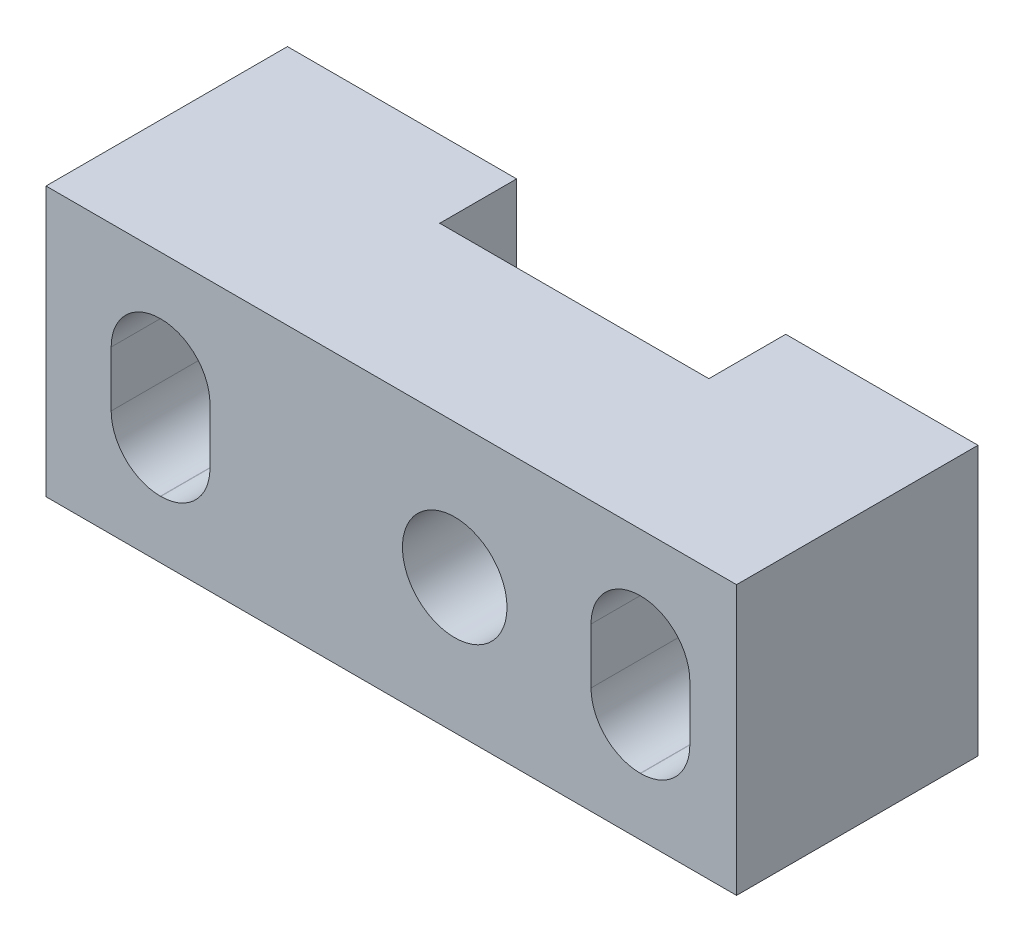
ISO-10303-21;
HEADER;
FILE_DESCRIPTION(('STEP AP214'),'2;1');
FILE_NAME('part.step','',(''),(''),'','','');
FILE_SCHEMA(('AUTOMOTIVE_DESIGN { 1 0 10303 214 1 1 1 1 }'));
ENDSEC;
DATA;
#1=APPLICATION_CONTEXT('core data for automotive mechanical design processes');
#2=APPLICATION_PROTOCOL_DEFINITION('international standard','automotive_design',2000,#1);
#3=PRODUCT_CONTEXT('',#1,'mechanical');
#4=PRODUCT('Part','Part','',(#3));
#5=PRODUCT_RELATED_PRODUCT_CATEGORY('part','',(#4));
#6=PRODUCT_DEFINITION_FORMATION('','',#4);
#7=PRODUCT_DEFINITION_CONTEXT('part definition',#1,'design');
#8=PRODUCT_DEFINITION('design','',#6,#7);
#9=PRODUCT_DEFINITION_SHAPE('','',#8);
#10=(LENGTH_UNIT() NAMED_UNIT(*) SI_UNIT(.MILLI.,.METRE.));
#11=(NAMED_UNIT(*) PLANE_ANGLE_UNIT() SI_UNIT($,.RADIAN.));
#12=(NAMED_UNIT(*) SI_UNIT($,.STERADIAN.) SOLID_ANGLE_UNIT());
#13=UNCERTAINTY_MEASURE_WITH_UNIT(LENGTH_MEASURE(1.E-05),#10,'distance_accuracy_value','');
#14=(GEOMETRIC_REPRESENTATION_CONTEXT(3) GLOBAL_UNCERTAINTY_ASSIGNED_CONTEXT((#13)) GLOBAL_UNIT_ASSIGNED_CONTEXT((#10,
#11,#12)) REPRESENTATION_CONTEXT('',''));
#15=CARTESIAN_POINT('',(0.,0.,0.));
#16=DIRECTION('',(0.,0.,1.));
#17=DIRECTION('',(1.,0.,0.));
#18=AXIS2_PLACEMENT_3D('',#15,#16,#17);
#19=CARTESIAN_POINT('',(-13.5001,-8.89,0.));
#20=DIRECTION('',(0.,0.,1.));
#21=DIRECTION('',(1.,0.,0.));
#22=AXIS2_PLACEMENT_3D('',#19,#20,#21);
#23=PLANE('',#22);
#24=DIRECTION('',(0.,1.,0.));
#25=VECTOR('',#24,1.);
#26=CARTESIAN_POINT('',(7.76605,-1.90499999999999,0.));
#27=LINE('',#26,#25);
#28=CARTESIAN_POINT('',(7.76605,-5.3594,0.));
#29=VERTEX_POINT('',#28);
#30=CARTESIAN_POINT('',(7.76605,-3.53059999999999,0.));
#31=VERTEX_POINT('',#30);
#32=EDGE_CURVE('E383',#29,#31,#27,.T.);
#33=ORIENTED_EDGE('',*,*,#32,.T.);
#34=CARTESIAN_POINT('',(6.14045,-3.53059999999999,0.));
#35=DIRECTION('',(0.,0.,1.));
#36=DIRECTION('',(1.,0.,0.));
#37=AXIS2_PLACEMENT_3D('',#34,#35,#36);
#38=CIRCLE('',#37,1.6256);
#39=CARTESIAN_POINT('',(6.14045,-1.90499999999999,0.));
#40=VERTEX_POINT('',#39);
#41=EDGE_CURVE('E297',#31,#40,#38,.T.);
#42=ORIENTED_EDGE('',*,*,#41,.T.);
#43=DIRECTION('',(-1.,0.,0.));
#44=VECTOR('',#43,1.);
#45=CARTESIAN_POINT('',(4.50215,-1.90499999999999,0.));
#46=LINE('',#45,#44);
#47=CARTESIAN_POINT('',(6.12775,-1.90499999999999,0.));
#48=VERTEX_POINT('',#47);
#49=EDGE_CURVE('E224',#40,#48,#46,.T.);
#50=ORIENTED_EDGE('',*,*,#49,.T.);
#51=CARTESIAN_POINT('',(6.12775,-3.53059999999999,0.));
#52=DIRECTION('',(0.,0.,1.));
#53=DIRECTION('',(1.,0.,0.));
#54=AXIS2_PLACEMENT_3D('',#51,#52,#53);
#55=CIRCLE('',#54,1.6256);
#56=CARTESIAN_POINT('',(4.50215,-3.53059999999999,0.));
#57=VERTEX_POINT('',#56);
#58=EDGE_CURVE('E293',#48,#57,#55,.T.);
#59=ORIENTED_EDGE('',*,*,#58,.T.);
#60=DIRECTION('',(0.,-1.,0.));
#61=VECTOR('',#60,1.);
#62=CARTESIAN_POINT('',(4.50215,-1.90499999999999,0.));
#63=LINE('',#62,#61);
#64=CARTESIAN_POINT('',(4.50215,-5.3594,0.));
#65=VERTEX_POINT('',#64);
#66=EDGE_CURVE('E376',#57,#65,#63,.T.);
#67=ORIENTED_EDGE('',*,*,#66,.T.);
#68=CARTESIAN_POINT('',(6.12775,-5.3594,0.));
#69=DIRECTION('',(0.,0.,1.));
#70=DIRECTION('',(1.,0.,0.));
#71=AXIS2_PLACEMENT_3D('',#68,#69,#70);
#72=CIRCLE('',#71,1.6256);
#73=CARTESIAN_POINT('',(6.12775,-6.985,0.));
#74=VERTEX_POINT('',#73);
#75=EDGE_CURVE('E305',#65,#74,#72,.T.);
#76=ORIENTED_EDGE('',*,*,#75,.T.);
#77=DIRECTION('',(1.,0.,0.));
#78=VECTOR('',#77,1.);
#79=CARTESIAN_POINT('',(4.50215,-6.985,0.));
#80=LINE('',#79,#78);
#81=CARTESIAN_POINT('',(6.14045,-6.985,0.));
#82=VERTEX_POINT('',#81);
#83=EDGE_CURVE('E379',#74,#82,#80,.T.);
#84=ORIENTED_EDGE('',*,*,#83,.T.);
#85=CARTESIAN_POINT('',(6.14045,-5.3594,0.));
#86=DIRECTION('',(0.,0.,1.));
#87=DIRECTION('',(1.,0.,0.));
#88=AXIS2_PLACEMENT_3D('',#85,#86,#87);
#89=CIRCLE('',#88,1.6256);
#90=EDGE_CURVE('E301',#82,#29,#89,.T.);
#91=ORIENTED_EDGE('',*,*,#90,.T.);
#92=EDGE_LOOP('',(#33,#42,#50,#59,#67,#76,#84,#91));
#93=FACE_BOUND('',#92,.T.);
#94=DIRECTION('',(1.,0.,0.));
#95=VECTOR('',#94,1.);
#96=CARTESIAN_POINT('',(-13.5001,-8.89,0.));
#97=LINE('',#96,#95);
#98=CARTESIAN_POINT('',(2.9591,-8.89,0.));
#99=VERTEX_POINT('',#98);
#100=CARTESIAN_POINT('',(9.3091,-8.89,0.));
#101=VERTEX_POINT('',#100);
#102=EDGE_CURVE('E250',#99,#101,#97,.T.);
#103=ORIENTED_EDGE('',*,*,#102,.F.);
#104=DIRECTION('',(0.,-1.,0.));
#105=VECTOR('',#104,1.);
#106=CARTESIAN_POINT('',(2.9591,-8.89,0.));
#107=LINE('',#106,#105);
#108=CARTESIAN_POINT('',(2.9591,0.,0.));
#109=VERTEX_POINT('',#108);
#110=EDGE_CURVE('E197',#109,#99,#107,.T.);
#111=ORIENTED_EDGE('',*,*,#110,.F.);
#112=DIRECTION('',(-1.,0.,0.));
#113=VECTOR('',#112,1.);
#114=CARTESIAN_POINT('',(-13.5001,0.,0.));
#115=LINE('',#114,#113);
#116=CARTESIAN_POINT('',(9.3091,0.,0.));
#117=VERTEX_POINT('',#116);
#118=EDGE_CURVE('E241',#117,#109,#115,.T.);
#119=ORIENTED_EDGE('',*,*,#118,.F.);
#120=DIRECTION('',(0.,1.,0.));
#121=VECTOR('',#120,1.);
#122=CARTESIAN_POINT('',(9.3091,0.,0.));
#123=LINE('',#122,#121);
#124=EDGE_CURVE('E253',#101,#117,#123,.T.);
#125=ORIENTED_EDGE('',*,*,#124,.F.);
#126=EDGE_LOOP('',(#103,#111,#119,#125));
#127=FACE_BOUND('',#126,.T.);
#128=ADVANCED_FACE('F30',(#93,#127),#23,.F.);
#129=CARTESIAN_POINT('',(-13.5001,0.,7.9756));
#130=DIRECTION('',(1.,0.,0.));
#131=DIRECTION('',(0.,1.,0.));
#132=AXIS2_PLACEMENT_3D('',#129,#130,#131);
#133=PLANE('',#132);
#134=DIRECTION('',(0.,-1.,0.));
#135=VECTOR('',#134,1.);
#136=CARTESIAN_POINT('',(-13.5001,0.,0.));
#137=LINE('',#136,#135);
#138=CARTESIAN_POINT('',(-13.5001,0.,0.));
#139=VERTEX_POINT('',#138);
#140=CARTESIAN_POINT('',(-13.5001,-8.89,0.));
#141=VERTEX_POINT('',#140);
#142=EDGE_CURVE('E236',#139,#141,#137,.T.);
#143=ORIENTED_EDGE('',*,*,#142,.T.);
#144=DIRECTION('',(0.,0.,-1.));
#145=VECTOR('',#144,1.);
#146=CARTESIAN_POINT('',(-13.5001,-8.89,7.9756));
#147=LINE('',#146,#145);
#148=CARTESIAN_POINT('',(-13.5001,-8.89,7.9756));
#149=VERTEX_POINT('',#148);
#150=EDGE_CURVE('E266',#149,#141,#147,.T.);
#151=ORIENTED_EDGE('',*,*,#150,.F.);
#152=DIRECTION('',(0.,-1.,0.));
#153=VECTOR('',#152,1.);
#154=CARTESIAN_POINT('',(-13.5001,0.,7.9756));
#155=LINE('',#154,#153);
#156=CARTESIAN_POINT('',(-13.5001,0.,7.9756));
#157=VERTEX_POINT('',#156);
#158=EDGE_CURVE('E237',#157,#149,#155,.T.);
#159=ORIENTED_EDGE('',*,*,#158,.F.);
#160=DIRECTION('',(0.,0.,-1.));
#161=VECTOR('',#160,1.);
#162=CARTESIAN_POINT('',(-13.5001,0.,7.9756));
#163=LINE('',#162,#161);
#164=EDGE_CURVE('E247',#157,#139,#163,.T.);
#165=ORIENTED_EDGE('',*,*,#164,.T.);
#166=EDGE_LOOP('',(#143,#151,#159,#165));
#167=FACE_BOUND('',#166,.T.);
#168=ADVANCED_FACE('F446',(#167),#133,.F.);
#169=CARTESIAN_POINT('',(-13.5001,-8.89,7.9756));
#170=DIRECTION('',(0.,1.,0.));
#171=DIRECTION('',(0.,0.,1.));
#172=AXIS2_PLACEMENT_3D('',#169,#170,#171);
#173=PLANE('',#172);
#174=DIRECTION('',(-1.,0.,0.));
#175=VECTOR('',#174,1.);
#176=CARTESIAN_POINT('',(2.9591,-8.89,2.54));
#177=LINE('',#176,#175);
#178=CARTESIAN_POINT('',(2.9591,-8.89,2.54));
#179=VERTEX_POINT('',#178);
#180=CARTESIAN_POINT('',(-5.9309,-8.89,2.54));
#181=VERTEX_POINT('',#180);
#182=EDGE_CURVE('E209',#179,#181,#177,.T.);
#183=ORIENTED_EDGE('',*,*,#182,.F.);
#184=DIRECTION('',(0.,0.,-1.));
#185=VECTOR('',#184,1.);
#186=CARTESIAN_POINT('',(2.9591,-8.89,2.54));
#187=LINE('',#186,#185);
#188=EDGE_CURVE('E191',#179,#99,#187,.T.);
#189=ORIENTED_EDGE('',*,*,#188,.T.);
#190=ORIENTED_EDGE('',*,*,#102,.T.);
#191=DIRECTION('',(0.,0.,-1.));
#192=VECTOR('',#191,1.);
#193=CARTESIAN_POINT('',(9.3091,-8.89,7.9756));
#194=LINE('',#193,#192);
#195=CARTESIAN_POINT('',(9.3091,-8.89,7.9756));
#196=VERTEX_POINT('',#195);
#197=EDGE_CURVE('E263',#196,#101,#194,.T.);
#198=ORIENTED_EDGE('',*,*,#197,.F.);
#199=DIRECTION('',(1.,0.,0.));
#200=VECTOR('',#199,1.);
#201=CARTESIAN_POINT('',(-13.5001,-8.89,7.9756));
#202=LINE('',#201,#200);
#203=EDGE_CURVE('E240',#149,#196,#202,.T.);
#204=ORIENTED_EDGE('',*,*,#203,.F.);
#205=ORIENTED_EDGE('',*,*,#150,.T.);
#206=CARTESIAN_POINT('',(-5.9309,-8.89,0.));
#207=VERTEX_POINT('',#206);
#208=EDGE_CURVE('E251',#141,#207,#97,.T.);
#209=ORIENTED_EDGE('',*,*,#208,.T.);
#210=DIRECTION('',(0.,0.,-1.));
#211=VECTOR('',#210,1.);
#212=CARTESIAN_POINT('',(-5.9309,-8.89,2.54));
#213=LINE('',#212,#211);
#214=EDGE_CURVE('E201',#181,#207,#213,.T.);
#215=ORIENTED_EDGE('',*,*,#214,.F.);
#216=EDGE_LOOP('',(#183,#189,#190,#198,#204,#205,#209,#215));
#217=FACE_BOUND('',#216,.T.);
#218=ADVANCED_FACE('F215',(#217),#173,.F.);
#219=CARTESIAN_POINT('',(9.3091,0.,7.9756));
#220=DIRECTION('',(-1.,0.,0.));
#221=DIRECTION('',(0.,-1.,0.));
#222=AXIS2_PLACEMENT_3D('',#219,#220,#221);
#223=PLANE('',#222);
#224=ORIENTED_EDGE('',*,*,#124,.T.);
#225=DIRECTION('',(0.,0.,-1.));
#226=VECTOR('',#225,1.);
#227=CARTESIAN_POINT('',(9.3091,0.,7.9756));
#228=LINE('',#227,#226);
#229=CARTESIAN_POINT('',(9.3091,0.,7.9756));
#230=VERTEX_POINT('',#229);
#231=EDGE_CURVE('E260',#230,#117,#228,.T.);
#232=ORIENTED_EDGE('',*,*,#231,.F.);
#233=DIRECTION('',(0.,1.,0.));
#234=VECTOR('',#233,1.);
#235=CARTESIAN_POINT('',(9.3091,0.,7.9756));
#236=LINE('',#235,#234);
#237=EDGE_CURVE('E243',#196,#230,#236,.T.);
#238=ORIENTED_EDGE('',*,*,#237,.F.);
#239=ORIENTED_EDGE('',*,*,#197,.T.);
#240=EDGE_LOOP('',(#224,#232,#238,#239));
#241=FACE_BOUND('',#240,.T.);
#242=ADVANCED_FACE('F452',(#241),#223,.F.);
#243=CARTESIAN_POINT('',(-13.5001,0.,7.9756));
#244=DIRECTION('',(0.,-1.,0.));
#245=DIRECTION('',(0.,0.,-1.));
#246=AXIS2_PLACEMENT_3D('',#243,#244,#245);
#247=PLANE('',#246);
#248=ORIENTED_EDGE('',*,*,#118,.T.);
#249=DIRECTION('',(0.,0.,-1.));
#250=VECTOR('',#249,1.);
#251=CARTESIAN_POINT('',(2.9591,0.,2.54));
#252=LINE('',#251,#250);
#253=CARTESIAN_POINT('',(2.9591,0.,2.54));
#254=VERTEX_POINT('',#253);
#255=EDGE_CURVE('E226',#254,#109,#252,.T.);
#256=ORIENTED_EDGE('',*,*,#255,.F.);
#257=DIRECTION('',(1.,0.,0.));
#258=VECTOR('',#257,1.);
#259=CARTESIAN_POINT('',(2.9591,0.,2.54));
#260=LINE('',#259,#258);
#261=CARTESIAN_POINT('',(-5.9309,0.,2.54));
#262=VERTEX_POINT('',#261);
#263=EDGE_CURVE('E202',#262,#254,#260,.T.);
#264=ORIENTED_EDGE('',*,*,#263,.F.);
#265=DIRECTION('',(0.,0.,-1.));
#266=VECTOR('',#265,1.);
#267=CARTESIAN_POINT('',(-5.9309,0.,2.54));
#268=LINE('',#267,#266);
#269=CARTESIAN_POINT('',(-5.9309,0.,0.));
#270=VERTEX_POINT('',#269);
#271=EDGE_CURVE('E229',#262,#270,#268,.T.);
#272=ORIENTED_EDGE('',*,*,#271,.T.);
#273=EDGE_CURVE('E255',#270,#139,#115,.T.);
#274=ORIENTED_EDGE('',*,*,#273,.T.);
#275=ORIENTED_EDGE('',*,*,#164,.F.);
#276=DIRECTION('',(-1.,0.,0.));
#277=VECTOR('',#276,1.);
#278=CARTESIAN_POINT('',(-13.5001,0.,7.9756));
#279=LINE('',#278,#277);
#280=EDGE_CURVE('E245',#230,#157,#279,.T.);
#281=ORIENTED_EDGE('',*,*,#280,.F.);
#282=ORIENTED_EDGE('',*,*,#231,.T.);
#283=EDGE_LOOP('',(#248,#256,#264,#272,#274,#275,#281,#282));
#284=FACE_BOUND('',#283,.T.);
#285=ADVANCED_FACE('F436',(#284),#247,.F.);
#286=CARTESIAN_POINT('',(-13.5001,-8.89,7.9756));
#287=DIRECTION('',(0.,0.,1.));
#288=DIRECTION('',(1.,0.,0.));
#289=AXIS2_PLACEMENT_3D('',#286,#287,#288);
#290=PLANE('',#289);
#291=DIRECTION('',(0.,-1.,0.));
#292=VECTOR('',#291,1.);
#293=CARTESIAN_POINT('',(-11.34745,-1.90499999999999,7.9756));
#294=LINE('',#293,#292);
#295=CARTESIAN_POINT('',(-11.34745,-3.53059999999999,7.9756));
#296=VERTEX_POINT('',#295);
#297=CARTESIAN_POINT('',(-11.34745,-5.3594,7.9756));
#298=VERTEX_POINT('',#297);
#299=EDGE_CURVE('E343',#296,#298,#294,.T.);
#300=ORIENTED_EDGE('',*,*,#299,.F.);
#301=CARTESIAN_POINT('',(-9.72185,-3.53059999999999,7.9756));
#302=DIRECTION('',(0.,0.,1.));
#303=DIRECTION('',(1.,0.,0.));
#304=AXIS2_PLACEMENT_3D('',#301,#302,#303);
#305=CIRCLE('',#304,1.6256);
#306=CARTESIAN_POINT('',(-9.72185,-1.90499999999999,7.9756));
#307=VERTEX_POINT('',#306);
#308=EDGE_CURVE('E38',#296,#307,#305,.F.);
#309=ORIENTED_EDGE('',*,*,#308,.T.);
#310=DIRECTION('',(-1.,0.,0.));
#311=VECTOR('',#310,1.);
#312=CARTESIAN_POINT('',(-11.34745,-1.90499999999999,7.9756));
#313=LINE('',#312,#311);
#314=CARTESIAN_POINT('',(-9.70915,-1.90499999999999,7.9756));
#315=VERTEX_POINT('',#314);
#316=EDGE_CURVE('E341',#315,#307,#313,.T.);
#317=ORIENTED_EDGE('',*,*,#316,.F.);
#318=CARTESIAN_POINT('',(-9.70915,-3.53059999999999,7.9756));
#319=DIRECTION('',(0.,0.,1.));
#320=DIRECTION('',(1.,0.,0.));
#321=AXIS2_PLACEMENT_3D('',#318,#319,#320);
#322=CIRCLE('',#321,1.6256);
#323=CARTESIAN_POINT('',(-8.08355,-3.53059999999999,7.9756));
#324=VERTEX_POINT('',#323);
#325=EDGE_CURVE('E334',#315,#324,#322,.F.);
#326=ORIENTED_EDGE('',*,*,#325,.T.);
#327=DIRECTION('',(0.,1.,0.));
#328=VECTOR('',#327,1.);
#329=CARTESIAN_POINT('',(-8.08355,-1.90499999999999,7.9756));
#330=LINE('',#329,#328);
#331=CARTESIAN_POINT('',(-8.08355,-5.3594,7.9756));
#332=VERTEX_POINT('',#331);
#333=EDGE_CURVE('E349',#332,#324,#330,.T.);
#334=ORIENTED_EDGE('',*,*,#333,.F.);
#335=CARTESIAN_POINT('',(-9.70915,-5.3594,7.9756));
#336=DIRECTION('',(0.,0.,1.));
#337=DIRECTION('',(1.,0.,0.));
#338=AXIS2_PLACEMENT_3D('',#335,#336,#337);
#339=CIRCLE('',#338,1.6256);
#340=CARTESIAN_POINT('',(-9.70915,-6.985,7.9756));
#341=VERTEX_POINT('',#340);
#342=EDGE_CURVE('E330',#332,#341,#339,.F.);
#343=ORIENTED_EDGE('',*,*,#342,.T.);
#344=DIRECTION('',(1.,0.,0.));
#345=VECTOR('',#344,1.);
#346=CARTESIAN_POINT('',(-11.34745,-6.985,7.9756));
#347=LINE('',#346,#345);
#348=CARTESIAN_POINT('',(-9.72185,-6.985,7.9756));
#349=VERTEX_POINT('',#348);
#350=EDGE_CURVE('E371',#349,#341,#347,.T.);
#351=ORIENTED_EDGE('',*,*,#350,.F.);
#352=CARTESIAN_POINT('',(-9.72185,-5.3594,7.9756));
#353=DIRECTION('',(0.,0.,1.));
#354=DIRECTION('',(1.,0.,0.));
#355=AXIS2_PLACEMENT_3D('',#352,#353,#354);
#356=CIRCLE('',#355,1.6256);
#357=EDGE_CURVE('E326',#349,#298,#356,.F.);
#358=ORIENTED_EDGE('',*,*,#357,.T.);
#359=EDGE_LOOP('',(#300,#309,#317,#326,#334,#343,#351,#358));
#360=FACE_BOUND('',#359,.T.);
#361=DIRECTION('',(0.,-1.,0.));
#362=VECTOR('',#361,1.);
#363=CARTESIAN_POINT('',(4.50215,-1.90499999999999,7.9756));
#364=LINE('',#363,#362);
#365=CARTESIAN_POINT('',(4.50215,-3.53059999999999,7.9756));
#366=VERTEX_POINT('',#365);
#367=CARTESIAN_POINT('',(4.50215,-5.3594,7.9756));
#368=VERTEX_POINT('',#367);
#369=EDGE_CURVE('E369',#366,#368,#364,.T.);
#370=ORIENTED_EDGE('',*,*,#369,.F.);
#371=CARTESIAN_POINT('',(6.12775,-3.53059999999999,7.9756));
#372=DIRECTION('',(0.,0.,1.));
#373=DIRECTION('',(1.,0.,0.));
#374=AXIS2_PLACEMENT_3D('',#371,#372,#373);
#375=CIRCLE('',#374,1.6256);
#376=CARTESIAN_POINT('',(6.12775,-1.90499999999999,7.9756));
#377=VERTEX_POINT('',#376);
#378=EDGE_CURVE('E291',#366,#377,#375,.F.);
#379=ORIENTED_EDGE('',*,*,#378,.T.);
#380=DIRECTION('',(-1.,0.,0.));
#381=VECTOR('',#380,1.);
#382=CARTESIAN_POINT('',(4.50215,-1.90499999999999,7.9756));
#383=LINE('',#382,#381);
#384=CARTESIAN_POINT('',(6.14045,-1.90499999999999,7.9756));
#385=VERTEX_POINT('',#384);
#386=EDGE_CURVE('E380',#385,#377,#383,.T.);
#387=ORIENTED_EDGE('',*,*,#386,.F.);
#388=CARTESIAN_POINT('',(6.14045,-3.53059999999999,7.9756));
#389=DIRECTION('',(0.,0.,1.));
#390=DIRECTION('',(1.,0.,0.));
#391=AXIS2_PLACEMENT_3D('',#388,#389,#390);
#392=CIRCLE('',#391,1.6256);
#393=CARTESIAN_POINT('',(7.76605,-3.53059999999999,7.9756));
#394=VERTEX_POINT('',#393);
#395=EDGE_CURVE('E295',#385,#394,#392,.F.);
#396=ORIENTED_EDGE('',*,*,#395,.T.);
#397=DIRECTION('',(0.,1.,0.));
#398=VECTOR('',#397,1.);
#399=CARTESIAN_POINT('',(7.76605,-1.90499999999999,7.9756));
#400=LINE('',#399,#398);
#401=CARTESIAN_POINT('',(7.76605,-5.3594,7.9756));
#402=VERTEX_POINT('',#401);
#403=EDGE_CURVE('E393',#402,#394,#400,.T.);
#404=ORIENTED_EDGE('',*,*,#403,.F.);
#405=CARTESIAN_POINT('',(6.14045,-5.3594,7.9756));
#406=DIRECTION('',(0.,0.,1.));
#407=DIRECTION('',(1.,0.,0.));
#408=AXIS2_PLACEMENT_3D('',#405,#406,#407);
#409=CIRCLE('',#408,1.6256);
#410=CARTESIAN_POINT('',(6.14045,-6.985,7.9756));
#411=VERTEX_POINT('',#410);
#412=EDGE_CURVE('E299',#402,#411,#409,.F.);
#413=ORIENTED_EDGE('',*,*,#412,.T.);
#414=DIRECTION('',(1.,0.,0.));
#415=VECTOR('',#414,1.);
#416=CARTESIAN_POINT('',(4.50215,-6.985,7.9756));
#417=LINE('',#416,#415);
#418=CARTESIAN_POINT('',(6.12775,-6.985,7.9756));
#419=VERTEX_POINT('',#418);
#420=EDGE_CURVE('E390',#419,#411,#417,.T.);
#421=ORIENTED_EDGE('',*,*,#420,.F.);
#422=CARTESIAN_POINT('',(6.12775,-5.3594,7.9756));
#423=DIRECTION('',(0.,0.,1.));
#424=DIRECTION('',(1.,0.,0.));
#425=AXIS2_PLACEMENT_3D('',#422,#423,#424);
#426=CIRCLE('',#425,1.6256);
#427=EDGE_CURVE('E303',#419,#368,#426,.F.);
#428=ORIENTED_EDGE('',*,*,#427,.T.);
#429=EDGE_LOOP('',(#370,#379,#387,#396,#404,#413,#421,#428));
#430=FACE_BOUND('',#429,.T.);
#431=CARTESIAN_POINT('',(0.,-4.445,7.9756));
#432=DIRECTION('',(0.,0.,1.));
#433=DIRECTION('',(1.,0.,0.));
#434=AXIS2_PLACEMENT_3D('',#431,#432,#433);
#435=CIRCLE('',#434,1.72719999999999);
#436=CARTESIAN_POINT('',(1.72719999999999,-4.445,7.9756));
#437=VERTEX_POINT('',#436);
#438=EDGE_CURVE('E233',#437,#437,#435,.T.);
#439=ORIENTED_EDGE('',*,*,#438,.F.);
#440=EDGE_LOOP('',(#439));
#441=FACE_BOUND('',#440,.T.);
#442=ORIENTED_EDGE('',*,*,#158,.T.);
#443=ORIENTED_EDGE('',*,*,#203,.T.);
#444=ORIENTED_EDGE('',*,*,#237,.T.);
#445=ORIENTED_EDGE('',*,*,#280,.T.);
#446=EDGE_LOOP('',(#442,#443,#444,#445));
#447=FACE_BOUND('',#446,.T.);
#448=ADVANCED_FACE('F339',(#360,#430,#441,#447),#290,.T.);
#449=DIRECTION('',(0.,1.,0.));
#450=VECTOR('',#449,1.);
#451=CARTESIAN_POINT('',(-8.08355,-1.90499999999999,0.));
#452=LINE('',#451,#450);
#453=CARTESIAN_POINT('',(-8.08355,-5.3594,0.));
#454=VERTEX_POINT('',#453);
#455=CARTESIAN_POINT('',(-8.08355,-3.53059999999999,0.));
#456=VERTEX_POINT('',#455);
#457=EDGE_CURVE('E364',#454,#456,#452,.T.);
#458=ORIENTED_EDGE('',*,*,#457,.T.);
#459=CARTESIAN_POINT('',(-9.70915,-3.53059999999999,0.));
#460=DIRECTION('',(0.,0.,1.));
#461=DIRECTION('',(1.,0.,0.));
#462=AXIS2_PLACEMENT_3D('',#459,#460,#461);
#463=CIRCLE('',#462,1.6256);
#464=CARTESIAN_POINT('',(-9.70915,-1.90499999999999,0.));
#465=VERTEX_POINT('',#464);
#466=EDGE_CURVE('E52',#456,#465,#463,.T.);
#467=ORIENTED_EDGE('',*,*,#466,.T.);
#468=DIRECTION('',(-1.,0.,0.));
#469=VECTOR('',#468,1.);
#470=CARTESIAN_POINT('',(-11.34745,-1.90499999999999,0.));
#471=LINE('',#470,#469);
#472=CARTESIAN_POINT('',(-9.72185,-1.90499999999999,0.));
#473=VERTEX_POINT('',#472);
#474=EDGE_CURVE('E357',#465,#473,#471,.T.);
#475=ORIENTED_EDGE('',*,*,#474,.T.);
#476=CARTESIAN_POINT('',(-9.72185,-3.53059999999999,0.));
#477=DIRECTION('',(0.,0.,1.));
#478=DIRECTION('',(1.,0.,0.));
#479=AXIS2_PLACEMENT_3D('',#476,#477,#478);
#480=CIRCLE('',#479,1.6256);
#481=CARTESIAN_POINT('',(-11.34745,-3.53059999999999,0.));
#482=VERTEX_POINT('',#481);
#483=EDGE_CURVE('E11',#473,#482,#480,.T.);
#484=ORIENTED_EDGE('',*,*,#483,.T.);
#485=DIRECTION('',(0.,-1.,0.));
#486=VECTOR('',#485,1.);
#487=CARTESIAN_POINT('',(-11.34745,-1.90499999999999,0.));
#488=LINE('',#487,#486);
#489=CARTESIAN_POINT('',(-11.34745,-5.3594,0.));
#490=VERTEX_POINT('',#489);
#491=EDGE_CURVE('E348',#482,#490,#488,.T.);
#492=ORIENTED_EDGE('',*,*,#491,.T.);
#493=CARTESIAN_POINT('',(-9.72185,-5.3594,0.));
#494=DIRECTION('',(0.,0.,1.));
#495=DIRECTION('',(1.,0.,0.));
#496=AXIS2_PLACEMENT_3D('',#493,#494,#495);
#497=CIRCLE('',#496,1.6256);
#498=CARTESIAN_POINT('',(-9.72185,-6.985,0.));
#499=VERTEX_POINT('',#498);
#500=EDGE_CURVE('E328',#490,#499,#497,.T.);
#501=ORIENTED_EDGE('',*,*,#500,.T.);
#502=DIRECTION('',(1.,0.,0.));
#503=VECTOR('',#502,1.);
#504=CARTESIAN_POINT('',(-11.34745,-6.985,0.));
#505=LINE('',#504,#503);
#506=CARTESIAN_POINT('',(-9.70915,-6.985,0.));
#507=VERTEX_POINT('',#506);
#508=EDGE_CURVE('E361',#499,#507,#505,.T.);
#509=ORIENTED_EDGE('',*,*,#508,.T.);
#510=CARTESIAN_POINT('',(-9.70915,-5.3594,0.));
#511=DIRECTION('',(0.,0.,1.));
#512=DIRECTION('',(1.,0.,0.));
#513=AXIS2_PLACEMENT_3D('',#510,#511,#512);
#514=CIRCLE('',#513,1.6256);
#515=EDGE_CURVE('E332',#507,#454,#514,.T.);
#516=ORIENTED_EDGE('',*,*,#515,.T.);
#517=EDGE_LOOP('',(#458,#467,#475,#484,#492,#501,#509,#516));
#518=FACE_BOUND('',#517,.T.);
#519=ORIENTED_EDGE('',*,*,#273,.F.);
#520=DIRECTION('',(0.,1.,0.));
#521=VECTOR('',#520,1.);
#522=CARTESIAN_POINT('',(-5.9309,-8.89,0.));
#523=LINE('',#522,#521);
#524=EDGE_CURVE('E213',#207,#270,#523,.T.);
#525=ORIENTED_EDGE('',*,*,#524,.F.);
#526=ORIENTED_EDGE('',*,*,#208,.F.);
#527=ORIENTED_EDGE('',*,*,#142,.F.);
#528=EDGE_LOOP('',(#519,#525,#526,#527));
#529=FACE_BOUND('',#528,.T.);
#530=ADVANCED_FACE('F354',(#518,#529),#23,.F.);
#531=CARTESIAN_POINT('',(0.,-4.445,7.9756));
#532=DIRECTION('',(0.,0.,1.));
#533=DIRECTION('',(1.,0.,0.));
#534=AXIS2_PLACEMENT_3D('',#531,#532,#533);
#535=CYLINDRICAL_SURFACE('',#534,1.72719999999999);
#536=CARTESIAN_POINT('',(0.,-4.445,2.54));
#537=DIRECTION('',(0.,0.,1.));
#538=DIRECTION('',(1.,0.,0.));
#539=AXIS2_PLACEMENT_3D('',#536,#537,#538);
#540=CIRCLE('',#539,1.72719999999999);
#541=CARTESIAN_POINT('',(1.72719999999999,-4.445,2.54));
#542=VERTEX_POINT('',#541);
#543=EDGE_CURVE('E228',#542,#542,#540,.F.);
#544=ORIENTED_EDGE('',*,*,#543,.T.);
#545=EDGE_LOOP('',(#544));
#546=FACE_BOUND('',#545,.T.);
#547=ORIENTED_EDGE('',*,*,#438,.T.);
#548=EDGE_LOOP('',(#547));
#549=FACE_BOUND('',#548,.T.);
#550=ADVANCED_FACE('F467',(#546,#549),#535,.F.);
#551=CARTESIAN_POINT('',(2.9591,0.,2.54));
#552=DIRECTION('',(0.,0.,1.));
#553=DIRECTION('',(1.,0.,0.));
#554=AXIS2_PLACEMENT_3D('',#551,#552,#553);
#555=PLANE('',#554);
#556=DIRECTION('',(0.,-1.,0.));
#557=VECTOR('',#556,1.);
#558=CARTESIAN_POINT('',(2.9591,-8.89,2.54));
#559=LINE('',#558,#557);
#560=EDGE_CURVE('E194',#254,#179,#559,.T.);
#561=ORIENTED_EDGE('',*,*,#560,.T.);
#562=ORIENTED_EDGE('',*,*,#182,.T.);
#563=DIRECTION('',(0.,1.,0.));
#564=VECTOR('',#563,1.);
#565=CARTESIAN_POINT('',(-5.9309,-8.89,2.54));
#566=LINE('',#565,#564);
#567=EDGE_CURVE('E217',#181,#262,#566,.T.);
#568=ORIENTED_EDGE('',*,*,#567,.T.);
#569=ORIENTED_EDGE('',*,*,#263,.T.);
#570=EDGE_LOOP('',(#561,#562,#568,#569));
#571=FACE_BOUND('',#570,.T.);
#572=ORIENTED_EDGE('',*,*,#543,.F.);
#573=EDGE_LOOP('',(#572));
#574=FACE_BOUND('',#573,.T.);
#575=ADVANCED_FACE('F206',(#571,#574),#555,.F.);
#576=CARTESIAN_POINT('',(2.9591,-8.89,2.54));
#577=DIRECTION('',(1.,0.,0.));
#578=DIRECTION('',(0.,1.,0.));
#579=AXIS2_PLACEMENT_3D('',#576,#577,#578);
#580=PLANE('',#579);
#581=ORIENTED_EDGE('',*,*,#110,.T.);
#582=ORIENTED_EDGE('',*,*,#188,.F.);
#583=ORIENTED_EDGE('',*,*,#560,.F.);
#584=ORIENTED_EDGE('',*,*,#255,.T.);
#585=EDGE_LOOP('',(#581,#582,#583,#584));
#586=FACE_BOUND('',#585,.T.);
#587=ADVANCED_FACE('F193',(#586),#580,.F.);
#588=CARTESIAN_POINT('',(-5.9309,-8.89,2.54));
#589=DIRECTION('',(-1.,0.,0.));
#590=DIRECTION('',(0.,0.,1.));
#591=AXIS2_PLACEMENT_3D('',#588,#589,#590);
#592=PLANE('',#591);
#593=ORIENTED_EDGE('',*,*,#524,.T.);
#594=ORIENTED_EDGE('',*,*,#271,.F.);
#595=ORIENTED_EDGE('',*,*,#567,.F.);
#596=ORIENTED_EDGE('',*,*,#214,.T.);
#597=EDGE_LOOP('',(#593,#594,#595,#596));
#598=FACE_BOUND('',#597,.T.);
#599=ADVANCED_FACE('F458',(#598),#592,.F.);
#600=CARTESIAN_POINT('',(4.50215,-1.90499999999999,0.));
#601=DIRECTION('',(-1.,0.,0.));
#602=DIRECTION('',(0.,-1.,0.));
#603=AXIS2_PLACEMENT_3D('',#600,#601,#602);
#604=PLANE('',#603);
#605=ORIENTED_EDGE('',*,*,#66,.F.);
#606=DIRECTION('',(0.,0.,1.));
#607=VECTOR('',#606,1.);
#608=CARTESIAN_POINT('',(4.50215,-3.53059999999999,7.9756));
#609=LINE('',#608,#607);
#610=EDGE_CURVE('E273',#57,#366,#609,.T.);
#611=ORIENTED_EDGE('',*,*,#610,.T.);
#612=ORIENTED_EDGE('',*,*,#369,.T.);
#613=DIRECTION('',(0.,0.,1.));
#614=VECTOR('',#613,1.);
#615=CARTESIAN_POINT('',(4.50215,-5.3594,0.));
#616=LINE('',#615,#614);
#617=EDGE_CURVE('E269',#368,#65,#616,.F.);
#618=ORIENTED_EDGE('',*,*,#617,.T.);
#619=EDGE_LOOP('',(#605,#611,#612,#618));
#620=FACE_BOUND('',#619,.T.);
#621=ADVANCED_FACE('F411',(#620),#604,.F.);
#622=CARTESIAN_POINT('',(4.50215,-1.90499999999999,0.));
#623=DIRECTION('',(0.,1.,0.));
#624=DIRECTION('',(0.,0.,1.));
#625=AXIS2_PLACEMENT_3D('',#622,#623,#624);
#626=PLANE('',#625);
#627=ORIENTED_EDGE('',*,*,#386,.T.);
#628=DIRECTION('',(0.,0.,1.));
#629=VECTOR('',#628,1.);
#630=CARTESIAN_POINT('',(6.12775,-1.90499999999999,0.));
#631=LINE('',#630,#629);
#632=EDGE_CURVE('E279',#377,#48,#631,.F.);
#633=ORIENTED_EDGE('',*,*,#632,.T.);
#634=ORIENTED_EDGE('',*,*,#49,.F.);
#635=DIRECTION('',(0.,0.,1.));
#636=VECTOR('',#635,1.);
#637=CARTESIAN_POINT('',(6.14045,-1.90499999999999,7.9756));
#638=LINE('',#637,#636);
#639=EDGE_CURVE('E276',#40,#385,#638,.T.);
#640=ORIENTED_EDGE('',*,*,#639,.T.);
#641=EDGE_LOOP('',(#627,#633,#634,#640));
#642=FACE_BOUND('',#641,.T.);
#643=ADVANCED_FACE('F399',(#642),#626,.F.);
#644=CARTESIAN_POINT('',(7.76605,-1.90499999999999,0.));
#645=DIRECTION('',(1.,0.,0.));
#646=DIRECTION('',(0.,1.,0.));
#647=AXIS2_PLACEMENT_3D('',#644,#645,#646);
#648=PLANE('',#647);
#649=ORIENTED_EDGE('',*,*,#403,.T.);
#650=DIRECTION('',(0.,0.,1.));
#651=VECTOR('',#650,1.);
#652=CARTESIAN_POINT('',(7.76605,-3.53059999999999,0.));
#653=LINE('',#652,#651);
#654=EDGE_CURVE('E284',#394,#31,#653,.F.);
#655=ORIENTED_EDGE('',*,*,#654,.T.);
#656=ORIENTED_EDGE('',*,*,#32,.F.);
#657=DIRECTION('',(0.,0.,1.));
#658=VECTOR('',#657,1.);
#659=CARTESIAN_POINT('',(7.76605,-5.3594,7.9756));
#660=LINE('',#659,#658);
#661=EDGE_CURVE('E281',#29,#402,#660,.T.);
#662=ORIENTED_EDGE('',*,*,#661,.T.);
#663=EDGE_LOOP('',(#649,#655,#656,#662));
#664=FACE_BOUND('',#663,.T.);
#665=ADVANCED_FACE('F429',(#664),#648,.F.);
#666=CARTESIAN_POINT('',(4.50215,-6.985,0.));
#667=DIRECTION('',(0.,-1.,0.));
#668=DIRECTION('',(0.,0.,-1.));
#669=AXIS2_PLACEMENT_3D('',#666,#667,#668);
#670=PLANE('',#669);
#671=ORIENTED_EDGE('',*,*,#420,.T.);
#672=DIRECTION('',(0.,0.,1.));
#673=VECTOR('',#672,1.);
#674=CARTESIAN_POINT('',(6.14045,-6.985,0.));
#675=LINE('',#674,#673);
#676=EDGE_CURVE('E289',#411,#82,#675,.F.);
#677=ORIENTED_EDGE('',*,*,#676,.T.);
#678=ORIENTED_EDGE('',*,*,#83,.F.);
#679=DIRECTION('',(0.,0.,1.));
#680=VECTOR('',#679,1.);
#681=CARTESIAN_POINT('',(6.12775,-6.985,7.9756));
#682=LINE('',#681,#680);
#683=EDGE_CURVE('E286',#74,#419,#682,.T.);
#684=ORIENTED_EDGE('',*,*,#683,.T.);
#685=EDGE_LOOP('',(#671,#677,#678,#684));
#686=FACE_BOUND('',#685,.T.);
#687=ADVANCED_FACE('F420',(#686),#670,.F.);
#688=CARTESIAN_POINT('',(6.12775,-3.53059999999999,0.));
#689=DIRECTION('',(0.,0.,-1.));
#690=DIRECTION('',(-1.,0.,0.));
#691=AXIS2_PLACEMENT_3D('',#688,#689,#690);
#692=CYLINDRICAL_SURFACE('',#691,1.6256);
#693=ORIENTED_EDGE('',*,*,#58,.F.);
#694=ORIENTED_EDGE('',*,*,#632,.F.);
#695=ORIENTED_EDGE('',*,*,#378,.F.);
#696=ORIENTED_EDGE('',*,*,#610,.F.);
#697=EDGE_LOOP('',(#693,#694,#695,#696));
#698=FACE_BOUND('',#697,.T.);
#699=ADVANCED_FACE('F404',(#698),#692,.F.);
#700=CARTESIAN_POINT('',(6.14045,-3.53059999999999,0.));
#701=DIRECTION('',(0.,0.,-1.));
#702=DIRECTION('',(-1.,0.,0.));
#703=AXIS2_PLACEMENT_3D('',#700,#701,#702);
#704=CYLINDRICAL_SURFACE('',#703,1.6256);
#705=ORIENTED_EDGE('',*,*,#41,.F.);
#706=ORIENTED_EDGE('',*,*,#654,.F.);
#707=ORIENTED_EDGE('',*,*,#395,.F.);
#708=ORIENTED_EDGE('',*,*,#639,.F.);
#709=EDGE_LOOP('',(#705,#706,#707,#708));
#710=FACE_BOUND('',#709,.T.);
#711=ADVANCED_FACE('F433',(#710),#704,.F.);
#712=CARTESIAN_POINT('',(6.14045,-5.3594,0.));
#713=DIRECTION('',(0.,0.,-1.));
#714=DIRECTION('',(-1.,0.,0.));
#715=AXIS2_PLACEMENT_3D('',#712,#713,#714);
#716=CYLINDRICAL_SURFACE('',#715,1.6256);
#717=ORIENTED_EDGE('',*,*,#90,.F.);
#718=ORIENTED_EDGE('',*,*,#676,.F.);
#719=ORIENTED_EDGE('',*,*,#412,.F.);
#720=ORIENTED_EDGE('',*,*,#661,.F.);
#721=EDGE_LOOP('',(#717,#718,#719,#720));
#722=FACE_BOUND('',#721,.T.);
#723=ADVANCED_FACE('F424',(#722),#716,.F.);
#724=CARTESIAN_POINT('',(6.12775,-5.3594,0.));
#725=DIRECTION('',(0.,0.,-1.));
#726=DIRECTION('',(-1.,0.,0.));
#727=AXIS2_PLACEMENT_3D('',#724,#725,#726);
#728=CYLINDRICAL_SURFACE('',#727,1.6256);
#729=ORIENTED_EDGE('',*,*,#75,.F.);
#730=ORIENTED_EDGE('',*,*,#617,.F.);
#731=ORIENTED_EDGE('',*,*,#427,.F.);
#732=ORIENTED_EDGE('',*,*,#683,.F.);
#733=EDGE_LOOP('',(#729,#730,#731,#732));
#734=FACE_BOUND('',#733,.T.);
#735=ADVANCED_FACE('F415',(#734),#728,.F.);
#736=CARTESIAN_POINT('',(-11.34745,-1.90499999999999,0.));
#737=DIRECTION('',(-1.,0.,0.));
#738=DIRECTION('',(0.,-1.,0.));
#739=AXIS2_PLACEMENT_3D('',#736,#737,#738);
#740=PLANE('',#739);
#741=ORIENTED_EDGE('',*,*,#299,.T.);
#742=DIRECTION('',(0.,0.,1.));
#743=VECTOR('',#742,1.);
#744=CARTESIAN_POINT('',(-11.34745,-5.3594,0.));
#745=LINE('',#744,#743);
#746=EDGE_CURVE('E315',#298,#490,#745,.F.);
#747=ORIENTED_EDGE('',*,*,#746,.T.);
#748=ORIENTED_EDGE('',*,*,#491,.F.);
#749=DIRECTION('',(0.,0.,1.));
#750=VECTOR('',#749,1.);
#751=CARTESIAN_POINT('',(-11.34745,-3.53059999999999,7.9756));
#752=LINE('',#751,#750);
#753=EDGE_CURVE('E312',#482,#296,#752,.T.);
#754=ORIENTED_EDGE('',*,*,#753,.T.);
#755=EDGE_LOOP('',(#741,#747,#748,#754));
#756=FACE_BOUND('',#755,.T.);
#757=ADVANCED_FACE('F359',(#756),#740,.F.);
#758=CARTESIAN_POINT('',(-11.34745,-1.90499999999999,0.));
#759=DIRECTION('',(0.,1.,0.));
#760=DIRECTION('',(0.,0.,1.));
#761=AXIS2_PLACEMENT_3D('',#758,#759,#760);
#762=PLANE('',#761);
#763=ORIENTED_EDGE('',*,*,#474,.F.);
#764=DIRECTION('',(0.,0.,1.));
#765=VECTOR('',#764,1.);
#766=CARTESIAN_POINT('',(-9.70915,-1.90499999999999,7.9756));
#767=LINE('',#766,#765);
#768=EDGE_CURVE('E323',#465,#315,#767,.T.);
#769=ORIENTED_EDGE('',*,*,#768,.T.);
#770=ORIENTED_EDGE('',*,*,#316,.T.);
#771=DIRECTION('',(0.,0.,1.));
#772=VECTOR('',#771,1.);
#773=CARTESIAN_POINT('',(-9.72185,-1.90499999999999,0.));
#774=LINE('',#773,#772);
#775=EDGE_CURVE('E45',#307,#473,#774,.F.);
#776=ORIENTED_EDGE('',*,*,#775,.T.);
#777=EDGE_LOOP('',(#763,#769,#770,#776));
#778=FACE_BOUND('',#777,.T.);
#779=ADVANCED_FACE('F346',(#778),#762,.F.);
#780=CARTESIAN_POINT('',(-8.08355,-1.90499999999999,0.));
#781=DIRECTION('',(1.,0.,0.));
#782=DIRECTION('',(0.,1.,0.));
#783=AXIS2_PLACEMENT_3D('',#780,#781,#782);
#784=PLANE('',#783);
#785=ORIENTED_EDGE('',*,*,#457,.F.);
#786=DIRECTION('',(0.,0.,1.));
#787=VECTOR('',#786,1.);
#788=CARTESIAN_POINT('',(-8.08355,-5.3594,7.9756));
#789=LINE('',#788,#787);
#790=EDGE_CURVE('E319',#454,#332,#789,.T.);
#791=ORIENTED_EDGE('',*,*,#790,.T.);
#792=ORIENTED_EDGE('',*,*,#333,.T.);
#793=DIRECTION('',(0.,0.,1.));
#794=VECTOR('',#793,1.);
#795=CARTESIAN_POINT('',(-8.08355,-3.53059999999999,0.));
#796=LINE('',#795,#794);
#797=EDGE_CURVE('E317',#324,#456,#796,.F.);
#798=ORIENTED_EDGE('',*,*,#797,.T.);
#799=EDGE_LOOP('',(#785,#791,#792,#798));
#800=FACE_BOUND('',#799,.T.);
#801=ADVANCED_FACE('F497',(#800),#784,.F.);
#802=CARTESIAN_POINT('',(-11.34745,-6.985,0.));
#803=DIRECTION('',(0.,-1.,0.));
#804=DIRECTION('',(0.,0.,-1.));
#805=AXIS2_PLACEMENT_3D('',#802,#803,#804);
#806=PLANE('',#805);
#807=ORIENTED_EDGE('',*,*,#508,.F.);
#808=DIRECTION('',(0.,0.,1.));
#809=VECTOR('',#808,1.);
#810=CARTESIAN_POINT('',(-9.72185,-6.985,7.9756));
#811=LINE('',#810,#809);
#812=EDGE_CURVE('E309',#499,#349,#811,.T.);
#813=ORIENTED_EDGE('',*,*,#812,.T.);
#814=ORIENTED_EDGE('',*,*,#350,.T.);
#815=DIRECTION('',(0.,0.,1.));
#816=VECTOR('',#815,1.);
#817=CARTESIAN_POINT('',(-9.70915,-6.985,0.));
#818=LINE('',#817,#816);
#819=EDGE_CURVE('E307',#341,#507,#818,.F.);
#820=ORIENTED_EDGE('',*,*,#819,.T.);
#821=EDGE_LOOP('',(#807,#813,#814,#820));
#822=FACE_BOUND('',#821,.T.);
#823=ADVANCED_FACE('F493',(#822),#806,.F.);
#824=CARTESIAN_POINT('',(-9.72185,-5.3594,0.));
#825=DIRECTION('',(0.,0.,-1.));
#826=DIRECTION('',(-1.,0.,0.));
#827=AXIS2_PLACEMENT_3D('',#824,#825,#826);
#828=CYLINDRICAL_SURFACE('',#827,1.6256);
#829=ORIENTED_EDGE('',*,*,#500,.F.);
#830=ORIENTED_EDGE('',*,*,#746,.F.);
#831=ORIENTED_EDGE('',*,*,#357,.F.);
#832=ORIENTED_EDGE('',*,*,#812,.F.);
#833=EDGE_LOOP('',(#829,#830,#831,#832));
#834=FACE_BOUND('',#833,.T.);
#835=ADVANCED_FACE('F496',(#834),#828,.F.);
#836=CARTESIAN_POINT('',(-9.70915,-5.3594,0.));
#837=DIRECTION('',(0.,0.,-1.));
#838=DIRECTION('',(-1.,0.,0.));
#839=AXIS2_PLACEMENT_3D('',#836,#837,#838);
#840=CYLINDRICAL_SURFACE('',#839,1.6256);
#841=ORIENTED_EDGE('',*,*,#515,.F.);
#842=ORIENTED_EDGE('',*,*,#819,.F.);
#843=ORIENTED_EDGE('',*,*,#342,.F.);
#844=ORIENTED_EDGE('',*,*,#790,.F.);
#845=EDGE_LOOP('',(#841,#842,#843,#844));
#846=FACE_BOUND('',#845,.T.);
#847=ADVANCED_FACE('F522',(#846),#840,.F.);
#848=CARTESIAN_POINT('',(-9.70915,-3.53059999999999,0.));
#849=DIRECTION('',(0.,0.,-1.));
#850=DIRECTION('',(-1.,0.,0.));
#851=AXIS2_PLACEMENT_3D('',#848,#849,#850);
#852=CYLINDRICAL_SURFACE('',#851,1.6256);
#853=ORIENTED_EDGE('',*,*,#466,.F.);
#854=ORIENTED_EDGE('',*,*,#797,.F.);
#855=ORIENTED_EDGE('',*,*,#325,.F.);
#856=ORIENTED_EDGE('',*,*,#768,.F.);
#857=EDGE_LOOP('',(#853,#854,#855,#856));
#858=FACE_BOUND('',#857,.T.);
#859=ADVANCED_FACE('F530',(#858),#852,.F.);
#860=CARTESIAN_POINT('',(-9.72185,-3.53059999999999,0.));
#861=DIRECTION('',(0.,0.,-1.));
#862=DIRECTION('',(-1.,0.,0.));
#863=AXIS2_PLACEMENT_3D('',#860,#861,#862);
#864=CYLINDRICAL_SURFACE('',#863,1.6256);
#865=ORIENTED_EDGE('',*,*,#483,.F.);
#866=ORIENTED_EDGE('',*,*,#775,.F.);
#867=ORIENTED_EDGE('',*,*,#308,.F.);
#868=ORIENTED_EDGE('',*,*,#753,.F.);
#869=EDGE_LOOP('',(#865,#866,#867,#868));
#870=FACE_BOUND('',#869,.T.);
#871=ADVANCED_FACE('F32',(#870),#864,.F.);
#872=CLOSED_SHELL('',(#128,#168,#218,#242,#285,#448,#530,#550,#575,#587,#599,#621,#643,#665,
#687,#699,#711,#723,#735,#757,#779,#801,#823,#835,#847,#859,#871));
#873=MANIFOLD_SOLID_BREP('B2',#872);
#874=ADVANCED_BREP_SHAPE_REPRESENTATION('',(#18,#873),#14);
#875=SHAPE_DEFINITION_REPRESENTATION(#9,#874);
ENDSEC;
END-ISO-10303-21;
